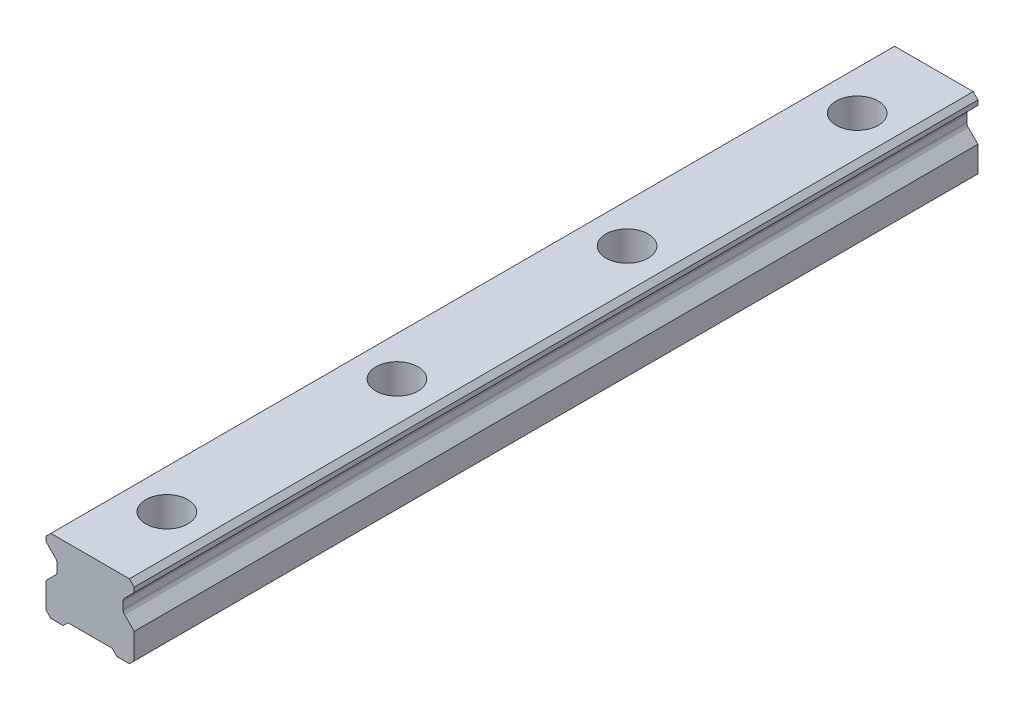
ISO-10303-21;
HEADER;
FILE_DESCRIPTION(('STEP AP214'),'2;1');
FILE_NAME('part.step','',(''),(''),'','','');
FILE_SCHEMA(('AUTOMOTIVE_DESIGN { 1 0 10303 214 1 1 1 1 }'));
ENDSEC;
DATA;
#1=APPLICATION_CONTEXT('core data for automotive mechanical design processes');
#2=APPLICATION_PROTOCOL_DEFINITION('international standard','automotive_design',2000,#1);
#3=PRODUCT_CONTEXT('',#1,'mechanical');
#4=PRODUCT('Part','Part','',(#3));
#5=PRODUCT_RELATED_PRODUCT_CATEGORY('part','',(#4));
#6=PRODUCT_DEFINITION_FORMATION('','',#4);
#7=PRODUCT_DEFINITION_CONTEXT('part definition',#1,'design');
#8=PRODUCT_DEFINITION('design','',#6,#7);
#9=PRODUCT_DEFINITION_SHAPE('','',#8);
#10=(LENGTH_UNIT() NAMED_UNIT(*) SI_UNIT(.MILLI.,.METRE.));
#11=(NAMED_UNIT(*) PLANE_ANGLE_UNIT() SI_UNIT($,.RADIAN.));
#12=(NAMED_UNIT(*) SI_UNIT($,.STERADIAN.) SOLID_ANGLE_UNIT());
#13=UNCERTAINTY_MEASURE_WITH_UNIT(LENGTH_MEASURE(1.E-05),#10,'distance_accuracy_value','');
#14=(GEOMETRIC_REPRESENTATION_CONTEXT(3) GLOBAL_UNCERTAINTY_ASSIGNED_CONTEXT((#13)) GLOBAL_UNIT_ASSIGNED_CONTEXT((#10,
#11,#12)) REPRESENTATION_CONTEXT('',''));
#15=CARTESIAN_POINT('',(0.,0.,0.));
#16=DIRECTION('',(0.,0.,1.));
#17=DIRECTION('',(1.,0.,0.));
#18=AXIS2_PLACEMENT_3D('',#15,#16,#17);
#19=CARTESIAN_POINT('',(0.,10.2,-90.));
#20=DIRECTION('',(0.,1.,0.));
#21=DIRECTION('',(0.,0.,1.));
#22=AXIS2_PLACEMENT_3D('',#19,#20,#21);
#23=PLANE('',#22);
#24=CARTESIAN_POINT('',(0.,10.2,-90.));
#25=DIRECTION('',(0.,1.,0.));
#26=DIRECTION('',(0.,0.,1.));
#27=AXIS2_PLACEMENT_3D('',#24,#25,#26);
#28=CIRCLE('',#27,3.5);
#29=CARTESIAN_POINT('',(0.,10.2,-86.5));
#30=VERTEX_POINT('',#29);
#31=EDGE_CURVE('E372',#30,#30,#28,.T.);
#32=ORIENTED_EDGE('',*,*,#31,.F.);
#33=EDGE_LOOP('',(#32));
#34=FACE_BOUND('',#33,.T.);
#35=CARTESIAN_POINT('',(0.,10.2,-90.));
#36=DIRECTION('',(0.,1.,0.));
#37=DIRECTION('',(0.,0.,1.));
#38=AXIS2_PLACEMENT_3D('',#35,#36,#37);
#39=CIRCLE('',#38,5.5);
#40=CARTESIAN_POINT('',(0.,10.2,-84.5));
#41=VERTEX_POINT('',#40);
#42=EDGE_CURVE('E11',#41,#41,#39,.T.);
#43=ORIENTED_EDGE('',*,*,#42,.T.);
#44=EDGE_LOOP('',(#43));
#45=FACE_BOUND('',#44,.T.);
#46=ADVANCED_FACE('F39',(#34,#45),#23,.T.);
#47=CARTESIAN_POINT('',(0.,10.2,-90.));
#48=DIRECTION('',(0.,1.,0.));
#49=DIRECTION('',(0.,0.,1.));
#50=AXIS2_PLACEMENT_3D('',#47,#48,#49);
#51=CYLINDRICAL_SURFACE('',#50,5.5);
#52=ORIENTED_EDGE('',*,*,#42,.F.);
#53=EDGE_LOOP('',(#52));
#54=FACE_BOUND('',#53,.T.);
#55=CARTESIAN_POINT('',(0.,19.2,-90.));
#56=DIRECTION('',(0.,1.,0.));
#57=DIRECTION('',(0.,0.,1.));
#58=AXIS2_PLACEMENT_3D('',#55,#56,#57);
#59=CIRCLE('',#58,5.5);
#60=CARTESIAN_POINT('',(0.,19.2,-84.5));
#61=VERTEX_POINT('',#60);
#62=EDGE_CURVE('E48',#61,#61,#59,.T.);
#63=ORIENTED_EDGE('',*,*,#62,.T.);
#64=EDGE_LOOP('',(#63));
#65=FACE_BOUND('',#64,.T.);
#66=ADVANCED_FACE('F570',(#54,#65),#51,.F.);
#67=CARTESIAN_POINT('',(0.,10.2,-30.));
#68=DIRECTION('',(0.,1.,0.));
#69=DIRECTION('',(0.,0.,1.));
#70=AXIS2_PLACEMENT_3D('',#67,#68,#69);
#71=PLANE('',#70);
#72=CARTESIAN_POINT('',(0.,10.2,-30.));
#73=DIRECTION('',(0.,1.,0.));
#74=DIRECTION('',(0.,0.,1.));
#75=AXIS2_PLACEMENT_3D('',#72,#73,#74);
#76=CIRCLE('',#75,3.5);
#77=CARTESIAN_POINT('',(0.,10.2,-26.5));
#78=VERTEX_POINT('',#77);
#79=EDGE_CURVE('E385',#78,#78,#76,.T.);
#80=ORIENTED_EDGE('',*,*,#79,.F.);
#81=EDGE_LOOP('',(#80));
#82=FACE_BOUND('',#81,.T.);
#83=CARTESIAN_POINT('',(0.,10.2,-30.));
#84=DIRECTION('',(0.,1.,0.));
#85=DIRECTION('',(0.,0.,1.));
#86=AXIS2_PLACEMENT_3D('',#83,#84,#85);
#87=CIRCLE('',#86,5.5);
#88=CARTESIAN_POINT('',(0.,10.2,-24.5));
#89=VERTEX_POINT('',#88);
#90=EDGE_CURVE('E358',#89,#89,#87,.T.);
#91=ORIENTED_EDGE('',*,*,#90,.T.);
#92=EDGE_LOOP('',(#91));
#93=FACE_BOUND('',#92,.T.);
#94=ADVANCED_FACE('F575',(#82,#93),#71,.T.);
#95=CARTESIAN_POINT('',(0.,10.2,-30.));
#96=DIRECTION('',(0.,1.,0.));
#97=DIRECTION('',(0.,0.,1.));
#98=AXIS2_PLACEMENT_3D('',#95,#96,#97);
#99=CYLINDRICAL_SURFACE('',#98,5.5);
#100=ORIENTED_EDGE('',*,*,#90,.F.);
#101=EDGE_LOOP('',(#100));
#102=FACE_BOUND('',#101,.T.);
#103=CARTESIAN_POINT('',(0.,19.2,-30.));
#104=DIRECTION('',(0.,1.,0.));
#105=DIRECTION('',(0.,0.,1.));
#106=AXIS2_PLACEMENT_3D('',#103,#104,#105);
#107=CIRCLE('',#106,5.5);
#108=CARTESIAN_POINT('',(0.,19.2,-24.5));
#109=VERTEX_POINT('',#108);
#110=EDGE_CURVE('E354',#109,#109,#107,.T.);
#111=ORIENTED_EDGE('',*,*,#110,.T.);
#112=EDGE_LOOP('',(#111));
#113=FACE_BOUND('',#112,.T.);
#114=ADVANCED_FACE('F632',(#102,#113),#99,.F.);
#115=CARTESIAN_POINT('',(11.5,0.,110.));
#116=DIRECTION('',(0.,1.,0.));
#117=DIRECTION('',(-1.,0.,0.));
#118=AXIS2_PLACEMENT_3D('',#115,#116,#117);
#119=PLANE('',#118);
#120=DIRECTION('',(1.,0.,0.));
#121=VECTOR('',#120,1.);
#122=CARTESIAN_POINT('',(11.5,0.,-110.));
#123=LINE('',#122,#121);
#124=CARTESIAN_POINT('',(-10.25,0.,-110.));
#125=VERTEX_POINT('',#124);
#126=CARTESIAN_POINT('',(-7.,0.,-110.));
#127=VERTEX_POINT('',#126);
#128=EDGE_CURVE('E229',#125,#127,#123,.T.);
#129=ORIENTED_EDGE('',*,*,#128,.T.);
#130=DIRECTION('',(0.,0.,1.));
#131=VECTOR('',#130,1.);
#132=CARTESIAN_POINT('',(-7.,0.,-110.));
#133=LINE('',#132,#131);
#134=CARTESIAN_POINT('',(-7.,0.,110.));
#135=VERTEX_POINT('',#134);
#136=EDGE_CURVE('E426',#127,#135,#133,.T.);
#137=ORIENTED_EDGE('',*,*,#136,.T.);
#138=DIRECTION('',(1.,0.,0.));
#139=VECTOR('',#138,1.);
#140=CARTESIAN_POINT('',(11.5,0.,110.));
#141=LINE('',#140,#139);
#142=CARTESIAN_POINT('',(-10.25,0.,110.));
#143=VERTEX_POINT('',#142);
#144=EDGE_CURVE('E495',#143,#135,#141,.T.);
#145=ORIENTED_EDGE('',*,*,#144,.F.);
#146=DIRECTION('',(0.,0.,-1.));
#147=VECTOR('',#146,1.);
#148=CARTESIAN_POINT('',(-10.25,0.,110.));
#149=LINE('',#148,#147);
#150=EDGE_CURVE('E289',#143,#125,#149,.T.);
#151=ORIENTED_EDGE('',*,*,#150,.T.);
#152=EDGE_LOOP('',(#129,#137,#145,#151));
#153=FACE_BOUND('',#152,.T.);
#154=ADVANCED_FACE('F602',(#153),#119,.F.);
#155=CARTESIAN_POINT('',(-11.5,19.2,110.));
#156=DIRECTION('',(1.,0.,0.));
#157=DIRECTION('',(0.,1.,0.));
#158=AXIS2_PLACEMENT_3D('',#155,#156,#157);
#159=PLANE('',#158);
#160=DIRECTION('',(0.,-1.,0.));
#161=VECTOR('',#160,1.);
#162=CARTESIAN_POINT('',(-11.5,19.2,110.));
#163=LINE('',#162,#161);
#164=CARTESIAN_POINT('',(-11.5,17.95,110.));
#165=VERTEX_POINT('',#164);
#166=CARTESIAN_POINT('',(-11.5,16.7,110.));
#167=VERTEX_POINT('',#166);
#168=EDGE_CURVE('E491',#165,#167,#163,.T.);
#169=ORIENTED_EDGE('',*,*,#168,.F.);
#170=DIRECTION('',(0.,0.,-1.));
#171=VECTOR('',#170,1.);
#172=CARTESIAN_POINT('',(-11.5,17.95,110.));
#173=LINE('',#172,#171);
#174=CARTESIAN_POINT('',(-11.5,17.95,-110.));
#175=VERTEX_POINT('',#174);
#176=EDGE_CURVE('E252',#165,#175,#173,.T.);
#177=ORIENTED_EDGE('',*,*,#176,.T.);
#178=DIRECTION('',(0.,-1.,0.));
#179=VECTOR('',#178,1.);
#180=CARTESIAN_POINT('',(-11.5,19.2,-110.));
#181=LINE('',#180,#179);
#182=CARTESIAN_POINT('',(-11.5,16.7,-110.));
#183=VERTEX_POINT('',#182);
#184=EDGE_CURVE('E230',#175,#183,#181,.T.);
#185=ORIENTED_EDGE('',*,*,#184,.T.);
#186=DIRECTION('',(0.,0.,1.));
#187=VECTOR('',#186,1.);
#188=CARTESIAN_POINT('',(-11.5,16.7,-110.));
#189=LINE('',#188,#187);
#190=EDGE_CURVE('E446',#183,#167,#189,.T.);
#191=ORIENTED_EDGE('',*,*,#190,.T.);
#192=EDGE_LOOP('',(#169,#177,#185,#191));
#193=FACE_BOUND('',#192,.T.);
#194=ADVANCED_FACE('F520',(#193),#159,.F.);
#195=CARTESIAN_POINT('',(11.5,19.2,110.));
#196=DIRECTION('',(-1.,0.,0.));
#197=DIRECTION('',(0.,0.,1.));
#198=AXIS2_PLACEMENT_3D('',#195,#196,#197);
#199=PLANE('',#198);
#200=DIRECTION('',(0.,1.,0.));
#201=VECTOR('',#200,1.);
#202=CARTESIAN_POINT('',(11.5,19.2,110.));
#203=LINE('',#202,#201);
#204=CARTESIAN_POINT('',(11.5,1.25,110.));
#205=VERTEX_POINT('',#204);
#206=CARTESIAN_POINT('',(11.5,7.95,110.));
#207=VERTEX_POINT('',#206);
#208=EDGE_CURVE('E500',#205,#207,#203,.T.);
#209=ORIENTED_EDGE('',*,*,#208,.F.);
#210=DIRECTION('',(0.,0.,-1.));
#211=VECTOR('',#210,1.);
#212=CARTESIAN_POINT('',(11.5,1.25,110.));
#213=LINE('',#212,#211);
#214=CARTESIAN_POINT('',(11.5,1.25,-110.));
#215=VERTEX_POINT('',#214);
#216=EDGE_CURVE('E296',#205,#215,#213,.T.);
#217=ORIENTED_EDGE('',*,*,#216,.T.);
#218=DIRECTION('',(0.,1.,0.));
#219=VECTOR('',#218,1.);
#220=CARTESIAN_POINT('',(11.5,19.2,-110.));
#221=LINE('',#220,#219);
#222=CARTESIAN_POINT('',(11.5,7.95,-110.));
#223=VERTEX_POINT('',#222);
#224=EDGE_CURVE('E243',#215,#223,#221,.T.);
#225=ORIENTED_EDGE('',*,*,#224,.T.);
#226=DIRECTION('',(0.,0.,1.));
#227=VECTOR('',#226,1.);
#228=CARTESIAN_POINT('',(11.5,7.95,-110.));
#229=LINE('',#228,#227);
#230=EDGE_CURVE('E476',#223,#207,#229,.T.);
#231=ORIENTED_EDGE('',*,*,#230,.T.);
#232=EDGE_LOOP('',(#209,#217,#225,#231));
#233=FACE_BOUND('',#232,.T.);
#234=ADVANCED_FACE('F595',(#233),#199,.F.);
#235=CARTESIAN_POINT('',(-11.5,7.95,-110.));
#236=VERTEX_POINT('',#235);
#237=CARTESIAN_POINT('',(-11.5,1.24999999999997,-110.));
#238=VERTEX_POINT('',#237);
#239=EDGE_CURVE('E239',#236,#238,#181,.T.);
#240=ORIENTED_EDGE('',*,*,#239,.T.);
#241=DIRECTION('',(0.,0.,1.));
#242=VECTOR('',#241,1.);
#243=CARTESIAN_POINT('',(-11.5,1.24999999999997,110.));
#244=LINE('',#243,#242);
#245=CARTESIAN_POINT('',(-11.5,1.24999999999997,110.));
#246=VERTEX_POINT('',#245);
#247=EDGE_CURVE('E293',#238,#246,#244,.T.);
#248=ORIENTED_EDGE('',*,*,#247,.T.);
#249=CARTESIAN_POINT('',(-11.5,7.95,110.));
#250=VERTEX_POINT('',#249);
#251=EDGE_CURVE('E251',#250,#246,#163,.T.);
#252=ORIENTED_EDGE('',*,*,#251,.F.);
#253=DIRECTION('',(0.,0.,1.));
#254=VECTOR('',#253,1.);
#255=CARTESIAN_POINT('',(-11.5,7.95,-110.));
#256=LINE('',#255,#254);
#257=EDGE_CURVE('E458',#236,#250,#256,.T.);
#258=ORIENTED_EDGE('',*,*,#257,.F.);
#259=EDGE_LOOP('',(#240,#248,#252,#258));
#260=FACE_BOUND('',#259,.T.);
#261=ADVANCED_FACE('F548',(#260),#159,.F.);
#262=CARTESIAN_POINT('',(7.,0.,110.));
#263=VERTEX_POINT('',#262);
#264=CARTESIAN_POINT('',(10.25,0.,110.));
#265=VERTEX_POINT('',#264);
#266=EDGE_CURVE('E219',#263,#265,#141,.T.);
#267=ORIENTED_EDGE('',*,*,#266,.F.);
#268=DIRECTION('',(0.,0.,1.));
#269=VECTOR('',#268,1.);
#270=CARTESIAN_POINT('',(7.,0.,-110.));
#271=LINE('',#270,#269);
#272=CARTESIAN_POINT('',(7.,0.,-110.));
#273=VERTEX_POINT('',#272);
#274=EDGE_CURVE('E206',#273,#263,#271,.T.);
#275=ORIENTED_EDGE('',*,*,#274,.F.);
#276=CARTESIAN_POINT('',(10.25,0.,-110.));
#277=VERTEX_POINT('',#276);
#278=EDGE_CURVE('E217',#273,#277,#123,.T.);
#279=ORIENTED_EDGE('',*,*,#278,.T.);
#280=DIRECTION('',(0.,0.,1.));
#281=VECTOR('',#280,1.);
#282=CARTESIAN_POINT('',(10.25,0.,110.));
#283=LINE('',#282,#281);
#284=EDGE_CURVE('E286',#277,#265,#283,.T.);
#285=ORIENTED_EDGE('',*,*,#284,.T.);
#286=EDGE_LOOP('',(#267,#275,#279,#285));
#287=FACE_BOUND('',#286,.T.);
#288=ADVANCED_FACE('F215',(#287),#119,.F.);
#289=CARTESIAN_POINT('',(11.5,16.7,-110.));
#290=VERTEX_POINT('',#289);
#291=CARTESIAN_POINT('',(11.5,17.95,-110.));
#292=VERTEX_POINT('',#291);
#293=EDGE_CURVE('E236',#290,#292,#221,.T.);
#294=ORIENTED_EDGE('',*,*,#293,.T.);
#295=DIRECTION('',(0.,0.,1.));
#296=VECTOR('',#295,1.);
#297=CARTESIAN_POINT('',(11.5,17.95,110.));
#298=LINE('',#297,#296);
#299=CARTESIAN_POINT('',(11.5,17.95,110.));
#300=VERTEX_POINT('',#299);
#301=EDGE_CURVE('E300',#292,#300,#298,.T.);
#302=ORIENTED_EDGE('',*,*,#301,.T.);
#303=CARTESIAN_POINT('',(11.5,16.7,110.));
#304=VERTEX_POINT('',#303);
#305=EDGE_CURVE('E499',#304,#300,#203,.T.);
#306=ORIENTED_EDGE('',*,*,#305,.F.);
#307=DIRECTION('',(0.,0.,1.));
#308=VECTOR('',#307,1.);
#309=CARTESIAN_POINT('',(11.5,16.7,-110.));
#310=LINE('',#309,#308);
#311=EDGE_CURVE('E451',#290,#304,#310,.T.);
#312=ORIENTED_EDGE('',*,*,#311,.F.);
#313=EDGE_LOOP('',(#294,#302,#306,#312));
#314=FACE_BOUND('',#313,.T.);
#315=ADVANCED_FACE('F585',(#314),#199,.F.);
#316=CARTESIAN_POINT('',(11.5,19.2,110.));
#317=DIRECTION('',(0.,-1.,0.));
#318=DIRECTION('',(0.,0.,-1.));
#319=AXIS2_PLACEMENT_3D('',#316,#317,#318);
#320=PLANE('',#319);
#321=CARTESIAN_POINT('',(0.,19.2,30.));
#322=DIRECTION('',(0.,1.,0.));
#323=DIRECTION('',(0.,0.,1.));
#324=AXIS2_PLACEMENT_3D('',#321,#322,#323);
#325=CIRCLE('',#324,5.5);
#326=CARTESIAN_POINT('',(0.,19.2,35.5));
#327=VERTEX_POINT('',#326);
#328=EDGE_CURVE('E389',#327,#327,#325,.T.);
#329=ORIENTED_EDGE('',*,*,#328,.F.);
#330=EDGE_LOOP('',(#329));
#331=FACE_BOUND('',#330,.T.);
#332=CARTESIAN_POINT('',(0.,19.2,90.));
#333=DIRECTION('',(0.,1.,0.));
#334=DIRECTION('',(0.,0.,1.));
#335=AXIS2_PLACEMENT_3D('',#332,#333,#334);
#336=CIRCLE('',#335,5.5);
#337=CARTESIAN_POINT('',(0.,19.2,95.5));
#338=VERTEX_POINT('',#337);
#339=EDGE_CURVE('E405',#338,#338,#336,.T.);
#340=ORIENTED_EDGE('',*,*,#339,.F.);
#341=EDGE_LOOP('',(#340));
#342=FACE_BOUND('',#341,.T.);
#343=DIRECTION('',(-1.,0.,0.));
#344=VECTOR('',#343,1.);
#345=CARTESIAN_POINT('',(11.5,19.2,-110.));
#346=LINE('',#345,#344);
#347=CARTESIAN_POINT('',(10.25,19.2,-110.));
#348=VERTEX_POINT('',#347);
#349=CARTESIAN_POINT('',(-10.25,19.2,-110.));
#350=VERTEX_POINT('',#349);
#351=EDGE_CURVE('E247',#348,#350,#346,.T.);
#352=ORIENTED_EDGE('',*,*,#351,.T.);
#353=DIRECTION('',(0.,0.,1.));
#354=VECTOR('',#353,1.);
#355=CARTESIAN_POINT('',(-10.25,19.2,110.));
#356=LINE('',#355,#354);
#357=CARTESIAN_POINT('',(-10.25,19.2,110.));
#358=VERTEX_POINT('',#357);
#359=EDGE_CURVE('E272',#350,#358,#356,.T.);
#360=ORIENTED_EDGE('',*,*,#359,.T.);
#361=DIRECTION('',(-1.,0.,0.));
#362=VECTOR('',#361,1.);
#363=CARTESIAN_POINT('',(11.5,19.2,110.));
#364=LINE('',#363,#362);
#365=CARTESIAN_POINT('',(10.25,19.2,110.));
#366=VERTEX_POINT('',#365);
#367=EDGE_CURVE('E257',#366,#358,#364,.T.);
#368=ORIENTED_EDGE('',*,*,#367,.F.);
#369=DIRECTION('',(0.,0.,-1.));
#370=VECTOR('',#369,1.);
#371=CARTESIAN_POINT('',(10.25,19.2,110.));
#372=LINE('',#371,#370);
#373=EDGE_CURVE('E268',#366,#348,#372,.T.);
#374=ORIENTED_EDGE('',*,*,#373,.T.);
#375=EDGE_LOOP('',(#352,#360,#368,#374));
#376=FACE_BOUND('',#375,.T.);
#377=ORIENTED_EDGE('',*,*,#110,.F.);
#378=EDGE_LOOP('',(#377));
#379=FACE_BOUND('',#378,.T.);
#380=ORIENTED_EDGE('',*,*,#62,.F.);
#381=EDGE_LOOP('',(#380));
#382=FACE_BOUND('',#381,.T.);
#383=ADVANCED_FACE('F583',(#331,#342,#376,#379,#382),#320,.F.);
#384=CARTESIAN_POINT('',(0.,0.,110.));
#385=DIRECTION('',(0.,0.,-1.));
#386=DIRECTION('',(-1.,0.,0.));
#387=AXIS2_PLACEMENT_3D('',#384,#385,#386);
#388=PLANE('',#387);
#389=ORIENTED_EDGE('',*,*,#144,.T.);
#390=DIRECTION('',(-0.707106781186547,-0.707106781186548,0.));
#391=VECTOR('',#390,1.);
#392=CARTESIAN_POINT('',(-7.,0.,110.));
#393=LINE('',#392,#391);
#394=CARTESIAN_POINT('',(-5.75,1.25,110.));
#395=VERTEX_POINT('',#394);
#396=EDGE_CURVE('E211',#395,#135,#393,.T.);
#397=ORIENTED_EDGE('',*,*,#396,.F.);
#398=DIRECTION('',(-1.,0.,0.));
#399=VECTOR('',#398,1.);
#400=CARTESIAN_POINT('',(-5.75,1.25,110.));
#401=LINE('',#400,#399);
#402=CARTESIAN_POINT('',(5.75,1.25,110.));
#403=VERTEX_POINT('',#402);
#404=EDGE_CURVE('E420',#403,#395,#401,.T.);
#405=ORIENTED_EDGE('',*,*,#404,.F.);
#406=DIRECTION('',(-0.707106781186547,0.707106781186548,0.));
#407=VECTOR('',#406,1.);
#408=CARTESIAN_POINT('',(5.75,1.25,110.));
#409=LINE('',#408,#407);
#410=EDGE_CURVE('E410',#263,#403,#409,.T.);
#411=ORIENTED_EDGE('',*,*,#410,.F.);
#412=ORIENTED_EDGE('',*,*,#266,.T.);
#413=DIRECTION('',(-0.707106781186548,-0.707106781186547,0.));
#414=VECTOR('',#413,1.);
#415=CARTESIAN_POINT('',(11.5,1.25,110.));
#416=LINE('',#415,#414);
#417=EDGE_CURVE('E278',#265,#205,#416,.F.);
#418=ORIENTED_EDGE('',*,*,#417,.T.);
#419=ORIENTED_EDGE('',*,*,#208,.T.);
#420=DIRECTION('',(0.707106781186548,-0.707106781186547,0.));
#421=VECTOR('',#420,1.);
#422=CARTESIAN_POINT('',(11.5,7.95,110.));
#423=LINE('',#422,#421);
#424=CARTESIAN_POINT('',(8.94944985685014,10.5005501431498,110.));
#425=VERTEX_POINT('',#424);
#426=EDGE_CURVE('E430',#425,#207,#423,.T.);
#427=ORIENTED_EDGE('',*,*,#426,.F.);
#428=CARTESIAN_POINT('',(9.83333333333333,11.384433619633,110.));
#429=DIRECTION('',(0.,0.,-1.));
#430=DIRECTION('',(-1.,0.,0.));
#431=AXIS2_PLACEMENT_3D('',#428,#429,#430);
#432=CIRCLE('',#431,1.25);
#433=CARTESIAN_POINT('',(8.58333333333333,11.384433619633,110.));
#434=VERTEX_POINT('',#433);
#435=EDGE_CURVE('E331',#425,#434,#432,.T.);
#436=ORIENTED_EDGE('',*,*,#435,.T.);
#437=DIRECTION('',(0.,-1.,0.));
#438=VECTOR('',#437,1.);
#439=CARTESIAN_POINT('',(8.58333333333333,10.8666666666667,110.));
#440=LINE('',#439,#438);
#441=CARTESIAN_POINT('',(8.58333333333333,13.265566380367,110.));
#442=VERTEX_POINT('',#441);
#443=EDGE_CURVE('E468',#442,#434,#440,.T.);
#444=ORIENTED_EDGE('',*,*,#443,.F.);
#445=CARTESIAN_POINT('',(9.83333333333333,13.265566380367,110.));
#446=DIRECTION('',(0.,0.,-1.));
#447=DIRECTION('',(-1.,0.,0.));
#448=AXIS2_PLACEMENT_3D('',#445,#446,#447);
#449=CIRCLE('',#448,1.25);
#450=CARTESIAN_POINT('',(8.94944985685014,14.1494498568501,110.));
#451=VERTEX_POINT('',#450);
#452=EDGE_CURVE('E337',#442,#451,#449,.T.);
#453=ORIENTED_EDGE('',*,*,#452,.T.);
#454=DIRECTION('',(-0.707106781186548,-0.707106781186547,0.));
#455=VECTOR('',#454,1.);
#456=CARTESIAN_POINT('',(8.58333333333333,13.7833333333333,110.));
#457=LINE('',#456,#455);
#458=EDGE_CURVE('E479',#304,#451,#457,.T.);
#459=ORIENTED_EDGE('',*,*,#458,.F.);
#460=ORIENTED_EDGE('',*,*,#305,.T.);
#461=DIRECTION('',(0.707106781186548,-0.707106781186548,0.));
#462=VECTOR('',#461,1.);
#463=CARTESIAN_POINT('',(10.25,19.2,110.));
#464=LINE('',#463,#462);
#465=EDGE_CURVE('E275',#300,#366,#464,.F.);
#466=ORIENTED_EDGE('',*,*,#465,.T.);
#467=ORIENTED_EDGE('',*,*,#367,.T.);
#468=DIRECTION('',(0.70710678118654,0.707106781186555,0.));
#469=VECTOR('',#468,1.);
#470=CARTESIAN_POINT('',(-11.5,17.95,110.));
#471=LINE('',#470,#469);
#472=EDGE_CURVE('E283',#358,#165,#471,.F.);
#473=ORIENTED_EDGE('',*,*,#472,.T.);
#474=ORIENTED_EDGE('',*,*,#168,.T.);
#475=DIRECTION('',(-0.707106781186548,0.707106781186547,0.));
#476=VECTOR('',#475,1.);
#477=CARTESIAN_POINT('',(-8.58333333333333,13.7833333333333,110.));
#478=LINE('',#477,#476);
#479=CARTESIAN_POINT('',(-8.94944985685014,14.1494498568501,110.));
#480=VERTEX_POINT('',#479);
#481=EDGE_CURVE('E447',#480,#167,#478,.T.);
#482=ORIENTED_EDGE('',*,*,#481,.F.);
#483=CARTESIAN_POINT('',(-9.83333333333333,13.265566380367,110.));
#484=DIRECTION('',(0.,0.,-1.));
#485=DIRECTION('',(-1.,0.,0.));
#486=AXIS2_PLACEMENT_3D('',#483,#484,#485);
#487=CIRCLE('',#486,1.25);
#488=CARTESIAN_POINT('',(-8.58333333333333,13.265566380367,110.));
#489=VERTEX_POINT('',#488);
#490=EDGE_CURVE('E349',#480,#489,#487,.T.);
#491=ORIENTED_EDGE('',*,*,#490,.T.);
#492=DIRECTION('',(0.,1.,0.));
#493=VECTOR('',#492,1.);
#494=CARTESIAN_POINT('',(-8.58333333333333,10.8666666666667,110.));
#495=LINE('',#494,#493);
#496=CARTESIAN_POINT('',(-8.58333333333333,11.384433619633,110.));
#497=VERTEX_POINT('',#496);
#498=EDGE_CURVE('E439',#497,#489,#495,.T.);
#499=ORIENTED_EDGE('',*,*,#498,.F.);
#500=CARTESIAN_POINT('',(-9.83333333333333,11.384433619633,110.));
#501=DIRECTION('',(0.,0.,-1.));
#502=DIRECTION('',(-1.,0.,0.));
#503=AXIS2_PLACEMENT_3D('',#500,#501,#502);
#504=CIRCLE('',#503,1.25);
#505=CARTESIAN_POINT('',(-8.94944985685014,10.5005501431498,110.));
#506=VERTEX_POINT('',#505);
#507=EDGE_CURVE('E343',#497,#506,#504,.T.);
#508=ORIENTED_EDGE('',*,*,#507,.T.);
#509=DIRECTION('',(0.707106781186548,0.707106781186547,0.));
#510=VECTOR('',#509,1.);
#511=CARTESIAN_POINT('',(-11.5,7.95,110.));
#512=LINE('',#511,#510);
#513=EDGE_CURVE('E450',#250,#506,#512,.T.);
#514=ORIENTED_EDGE('',*,*,#513,.F.);
#515=ORIENTED_EDGE('',*,*,#251,.T.);
#516=DIRECTION('',(-0.707106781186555,0.70710678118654,0.));
#517=VECTOR('',#516,1.);
#518=CARTESIAN_POINT('',(-10.25,0.,110.));
#519=LINE('',#518,#517);
#520=EDGE_CURVE('E281',#246,#143,#519,.F.);
#521=ORIENTED_EDGE('',*,*,#520,.T.);
#522=EDGE_LOOP('',(#389,#397,#405,#411,#412,#418,#419,#427,#436,#444,#453,#459,#460,#466,#467,
#473,#474,#482,#491,#499,#508,#514,#515,#521));
#523=FACE_BOUND('',#522,.T.);
#524=ADVANCED_FACE('F508',(#523),#388,.F.);
#525=CARTESIAN_POINT('',(0.,0.,-110.));
#526=DIRECTION('',(0.,0.,-1.));
#527=DIRECTION('',(-1.,0.,0.));
#528=AXIS2_PLACEMENT_3D('',#525,#526,#527);
#529=PLANE('',#528);
#530=DIRECTION('',(-0.707106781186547,-0.707106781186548,0.));
#531=VECTOR('',#530,1.);
#532=CARTESIAN_POINT('',(-7.,0.,-110.));
#533=LINE('',#532,#531);
#534=CARTESIAN_POINT('',(-5.75,1.25,-110.));
#535=VERTEX_POINT('',#534);
#536=EDGE_CURVE('E221',#535,#127,#533,.T.);
#537=ORIENTED_EDGE('',*,*,#536,.T.);
#538=ORIENTED_EDGE('',*,*,#128,.F.);
#539=DIRECTION('',(0.707106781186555,-0.70710678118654,0.));
#540=VECTOR('',#539,1.);
#541=CARTESIAN_POINT('',(-5.12499999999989,-5.125,-110.));
#542=LINE('',#541,#540);
#543=EDGE_CURVE('E262',#125,#238,#542,.F.);
#544=ORIENTED_EDGE('',*,*,#543,.T.);
#545=ORIENTED_EDGE('',*,*,#239,.F.);
#546=DIRECTION('',(0.707106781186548,0.707106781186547,0.));
#547=VECTOR('',#546,1.);
#548=CARTESIAN_POINT('',(-11.5,7.95,-110.));
#549=LINE('',#548,#547);
#550=CARTESIAN_POINT('',(-8.94944985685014,10.5005501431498,-110.));
#551=VERTEX_POINT('',#550);
#552=EDGE_CURVE('E438',#236,#551,#549,.T.);
#553=ORIENTED_EDGE('',*,*,#552,.T.);
#554=CARTESIAN_POINT('',(-9.83333333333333,11.384433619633,-110.));
#555=DIRECTION('',(0.,0.,-1.));
#556=DIRECTION('',(-1.,0.,0.));
#557=AXIS2_PLACEMENT_3D('',#554,#555,#556);
#558=CIRCLE('',#557,1.25);
#559=CARTESIAN_POINT('',(-8.58333333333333,11.384433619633,-110.));
#560=VERTEX_POINT('',#559);
#561=EDGE_CURVE('E346',#551,#560,#558,.F.);
#562=ORIENTED_EDGE('',*,*,#561,.T.);
#563=DIRECTION('',(0.,1.,0.));
#564=VECTOR('',#563,1.);
#565=CARTESIAN_POINT('',(-8.58333333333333,10.8666666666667,-110.));
#566=LINE('',#565,#564);
#567=CARTESIAN_POINT('',(-8.58333333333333,13.265566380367,-110.));
#568=VERTEX_POINT('',#567);
#569=EDGE_CURVE('E443',#560,#568,#566,.T.);
#570=ORIENTED_EDGE('',*,*,#569,.T.);
#571=CARTESIAN_POINT('',(-9.83333333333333,13.265566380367,-110.));
#572=DIRECTION('',(0.,0.,-1.));
#573=DIRECTION('',(-1.,0.,0.));
#574=AXIS2_PLACEMENT_3D('',#571,#572,#573);
#575=CIRCLE('',#574,1.25);
#576=CARTESIAN_POINT('',(-8.94944985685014,14.1494498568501,-110.));
#577=VERTEX_POINT('',#576);
#578=EDGE_CURVE('E64',#568,#577,#575,.F.);
#579=ORIENTED_EDGE('',*,*,#578,.T.);
#580=DIRECTION('',(-0.707106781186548,0.707106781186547,0.));
#581=VECTOR('',#580,1.);
#582=CARTESIAN_POINT('',(-8.58333333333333,13.7833333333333,-110.));
#583=LINE('',#582,#581);
#584=EDGE_CURVE('E435',#577,#183,#583,.T.);
#585=ORIENTED_EDGE('',*,*,#584,.T.);
#586=ORIENTED_EDGE('',*,*,#184,.F.);
#587=DIRECTION('',(-0.70710678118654,-0.707106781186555,0.));
#588=VECTOR('',#587,1.);
#589=CARTESIAN_POINT('',(-14.7250000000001,14.7249999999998,-110.));
#590=LINE('',#589,#588);
#591=EDGE_CURVE('E265',#175,#350,#590,.F.);
#592=ORIENTED_EDGE('',*,*,#591,.T.);
#593=ORIENTED_EDGE('',*,*,#351,.F.);
#594=DIRECTION('',(-0.707106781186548,0.707106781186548,0.));
#595=VECTOR('',#594,1.);
#596=CARTESIAN_POINT('',(14.725,14.725,-110.));
#597=LINE('',#596,#595);
#598=EDGE_CURVE('E256',#348,#292,#597,.F.);
#599=ORIENTED_EDGE('',*,*,#598,.T.);
#600=ORIENTED_EDGE('',*,*,#293,.F.);
#601=DIRECTION('',(-0.707106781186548,-0.707106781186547,0.));
#602=VECTOR('',#601,1.);
#603=CARTESIAN_POINT('',(8.58333333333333,13.7833333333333,-110.));
#604=LINE('',#603,#602);
#605=CARTESIAN_POINT('',(8.94944985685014,14.1494498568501,-110.));
#606=VERTEX_POINT('',#605);
#607=EDGE_CURVE('E467',#290,#606,#604,.T.);
#608=ORIENTED_EDGE('',*,*,#607,.T.);
#609=CARTESIAN_POINT('',(9.83333333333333,13.265566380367,-110.));
#610=DIRECTION('',(0.,0.,-1.));
#611=DIRECTION('',(-1.,0.,0.));
#612=AXIS2_PLACEMENT_3D('',#609,#610,#611);
#613=CIRCLE('',#612,1.25);
#614=CARTESIAN_POINT('',(8.58333333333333,13.265566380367,-110.));
#615=VERTEX_POINT('',#614);
#616=EDGE_CURVE('E340',#606,#615,#613,.F.);
#617=ORIENTED_EDGE('',*,*,#616,.T.);
#618=DIRECTION('',(0.,-1.,0.));
#619=VECTOR('',#618,1.);
#620=CARTESIAN_POINT('',(8.58333333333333,10.8666666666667,-110.));
#621=LINE('',#620,#619);
#622=CARTESIAN_POINT('',(8.58333333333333,11.384433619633,-110.));
#623=VERTEX_POINT('',#622);
#624=EDGE_CURVE('E472',#615,#623,#621,.T.);
#625=ORIENTED_EDGE('',*,*,#624,.T.);
#626=CARTESIAN_POINT('',(9.83333333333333,11.384433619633,-110.));
#627=DIRECTION('',(0.,0.,-1.));
#628=DIRECTION('',(-1.,0.,0.));
#629=AXIS2_PLACEMENT_3D('',#626,#627,#628);
#630=CIRCLE('',#629,1.25);
#631=CARTESIAN_POINT('',(8.94944985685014,10.5005501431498,-110.));
#632=VERTEX_POINT('',#631);
#633=EDGE_CURVE('E334',#623,#632,#630,.F.);
#634=ORIENTED_EDGE('',*,*,#633,.T.);
#635=DIRECTION('',(0.707106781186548,-0.707106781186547,0.));
#636=VECTOR('',#635,1.);
#637=CARTESIAN_POINT('',(11.5,7.95,-110.));
#638=LINE('',#637,#636);
#639=EDGE_CURVE('E464',#632,#223,#638,.T.);
#640=ORIENTED_EDGE('',*,*,#639,.T.);
#641=ORIENTED_EDGE('',*,*,#224,.F.);
#642=DIRECTION('',(0.707106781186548,0.707106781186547,0.));
#643=VECTOR('',#642,1.);
#644=CARTESIAN_POINT('',(5.12499999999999,-5.125,-110.));
#645=LINE('',#644,#643);
#646=EDGE_CURVE('E226',#215,#277,#645,.F.);
#647=ORIENTED_EDGE('',*,*,#646,.T.);
#648=ORIENTED_EDGE('',*,*,#278,.F.);
#649=DIRECTION('',(-0.707106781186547,0.707106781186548,0.));
#650=VECTOR('',#649,1.);
#651=CARTESIAN_POINT('',(5.75,1.25,-110.));
#652=LINE('',#651,#650);
#653=CARTESIAN_POINT('',(5.75,1.25,-110.));
#654=VERTEX_POINT('',#653);
#655=EDGE_CURVE('E202',#273,#654,#652,.T.);
#656=ORIENTED_EDGE('',*,*,#655,.T.);
#657=DIRECTION('',(-1.,0.,0.));
#658=VECTOR('',#657,1.);
#659=CARTESIAN_POINT('',(-5.75,1.25,-110.));
#660=LINE('',#659,#658);
#661=EDGE_CURVE('E56',#654,#535,#660,.T.);
#662=ORIENTED_EDGE('',*,*,#661,.T.);
#663=EDGE_LOOP('',(#537,#538,#544,#545,#553,#562,#570,#579,#585,#586,#592,#593,#599,#600,#608,
#617,#625,#634,#640,#641,#647,#648,#656,#662));
#664=FACE_BOUND('',#663,.T.);
#665=ADVANCED_FACE('F224',(#664),#529,.T.);
#666=CARTESIAN_POINT('',(11.5,7.95,-110.));
#667=DIRECTION('',(-0.707106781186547,-0.707106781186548,0.));
#668=DIRECTION('',(0.707106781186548,-0.707106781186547,0.));
#669=AXIS2_PLACEMENT_3D('',#666,#667,#668);
#670=PLANE('',#669);
#671=ORIENTED_EDGE('',*,*,#639,.F.);
#672=DIRECTION('',(0.,0.,1.));
#673=VECTOR('',#672,1.);
#674=CARTESIAN_POINT('',(8.94944985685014,10.5005501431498,110.));
#675=LINE('',#674,#673);
#676=EDGE_CURVE('E303',#632,#425,#675,.T.);
#677=ORIENTED_EDGE('',*,*,#676,.T.);
#678=ORIENTED_EDGE('',*,*,#426,.T.);
#679=ORIENTED_EDGE('',*,*,#230,.F.);
#680=EDGE_LOOP('',(#671,#677,#678,#679));
#681=FACE_BOUND('',#680,.T.);
#682=ADVANCED_FACE('F691',(#681),#670,.F.);
#683=CARTESIAN_POINT('',(8.58333333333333,10.8666666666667,-110.));
#684=DIRECTION('',(-1.,0.,0.));
#685=DIRECTION('',(0.,0.,1.));
#686=AXIS2_PLACEMENT_3D('',#683,#684,#685);
#687=PLANE('',#686);
#688=ORIENTED_EDGE('',*,*,#443,.T.);
#689=DIRECTION('',(0.,0.,1.));
#690=VECTOR('',#689,1.);
#691=CARTESIAN_POINT('',(8.58333333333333,11.384433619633,-110.));
#692=LINE('',#691,#690);
#693=EDGE_CURVE('E311',#434,#623,#692,.F.);
#694=ORIENTED_EDGE('',*,*,#693,.T.);
#695=ORIENTED_EDGE('',*,*,#624,.F.);
#696=DIRECTION('',(0.,0.,1.));
#697=VECTOR('',#696,1.);
#698=CARTESIAN_POINT('',(8.58333333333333,13.265566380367,110.));
#699=LINE('',#698,#697);
#700=EDGE_CURVE('E307',#615,#442,#699,.T.);
#701=ORIENTED_EDGE('',*,*,#700,.T.);
#702=EDGE_LOOP('',(#688,#694,#695,#701));
#703=FACE_BOUND('',#702,.T.);
#704=ADVANCED_FACE('F699',(#703),#687,.F.);
#705=CARTESIAN_POINT('',(8.58333333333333,13.7833333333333,-110.));
#706=DIRECTION('',(-0.707106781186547,0.707106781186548,0.));
#707=DIRECTION('',(-0.707106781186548,-0.707106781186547,0.));
#708=AXIS2_PLACEMENT_3D('',#705,#706,#707);
#709=PLANE('',#708);
#710=ORIENTED_EDGE('',*,*,#458,.T.);
#711=DIRECTION('',(0.,0.,1.));
#712=VECTOR('',#711,1.);
#713=CARTESIAN_POINT('',(8.94944985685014,14.1494498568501,-110.));
#714=LINE('',#713,#712);
#715=EDGE_CURVE('E314',#451,#606,#714,.F.);
#716=ORIENTED_EDGE('',*,*,#715,.T.);
#717=ORIENTED_EDGE('',*,*,#607,.F.);
#718=ORIENTED_EDGE('',*,*,#311,.T.);
#719=EDGE_LOOP('',(#710,#716,#717,#718));
#720=FACE_BOUND('',#719,.T.);
#721=ADVANCED_FACE('F709',(#720),#709,.F.);
#722=CARTESIAN_POINT('',(-8.58333333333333,13.7833333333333,-110.));
#723=DIRECTION('',(0.707106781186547,0.707106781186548,0.));
#724=DIRECTION('',(-0.707106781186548,0.707106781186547,0.));
#725=AXIS2_PLACEMENT_3D('',#722,#723,#724);
#726=PLANE('',#725);
#727=ORIENTED_EDGE('',*,*,#584,.F.);
#728=DIRECTION('',(0.,0.,1.));
#729=VECTOR('',#728,1.);
#730=CARTESIAN_POINT('',(-8.94944985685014,14.1494498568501,110.));
#731=LINE('',#730,#729);
#732=EDGE_CURVE('E327',#577,#480,#731,.T.);
#733=ORIENTED_EDGE('',*,*,#732,.T.);
#734=ORIENTED_EDGE('',*,*,#481,.T.);
#735=ORIENTED_EDGE('',*,*,#190,.F.);
#736=EDGE_LOOP('',(#727,#733,#734,#735));
#737=FACE_BOUND('',#736,.T.);
#738=ADVANCED_FACE('F525',(#737),#726,.F.);
#739=CARTESIAN_POINT('',(-8.58333333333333,10.8666666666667,-110.));
#740=DIRECTION('',(1.,0.,0.));
#741=DIRECTION('',(0.,0.,-1.));
#742=AXIS2_PLACEMENT_3D('',#739,#740,#741);
#743=PLANE('',#742);
#744=ORIENTED_EDGE('',*,*,#569,.F.);
#745=DIRECTION('',(0.,0.,1.));
#746=VECTOR('',#745,1.);
#747=CARTESIAN_POINT('',(-8.58333333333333,11.384433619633,110.));
#748=LINE('',#747,#746);
#749=EDGE_CURVE('E320',#560,#497,#748,.T.);
#750=ORIENTED_EDGE('',*,*,#749,.T.);
#751=ORIENTED_EDGE('',*,*,#498,.T.);
#752=DIRECTION('',(0.,0.,1.));
#753=VECTOR('',#752,1.);
#754=CARTESIAN_POINT('',(-8.58333333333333,13.265566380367,-110.));
#755=LINE('',#754,#753);
#756=EDGE_CURVE('E317',#489,#568,#755,.F.);
#757=ORIENTED_EDGE('',*,*,#756,.T.);
#758=EDGE_LOOP('',(#744,#750,#751,#757));
#759=FACE_BOUND('',#758,.T.);
#760=ADVANCED_FACE('F533',(#759),#743,.F.);
#761=CARTESIAN_POINT('',(-11.5,7.95,-110.));
#762=DIRECTION('',(0.707106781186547,-0.707106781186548,0.));
#763=DIRECTION('',(0.707106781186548,0.707106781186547,0.));
#764=AXIS2_PLACEMENT_3D('',#761,#762,#763);
#765=PLANE('',#764);
#766=ORIENTED_EDGE('',*,*,#513,.T.);
#767=DIRECTION('',(0.,0.,1.));
#768=VECTOR('',#767,1.);
#769=CARTESIAN_POINT('',(-8.94944985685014,10.5005501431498,-110.));
#770=LINE('',#769,#768);
#771=EDGE_CURVE('E324',#506,#551,#770,.F.);
#772=ORIENTED_EDGE('',*,*,#771,.T.);
#773=ORIENTED_EDGE('',*,*,#552,.F.);
#774=ORIENTED_EDGE('',*,*,#257,.T.);
#775=EDGE_LOOP('',(#766,#772,#773,#774));
#776=FACE_BOUND('',#775,.T.);
#777=ADVANCED_FACE('F543',(#776),#765,.F.);
#778=CARTESIAN_POINT('',(-11.5,17.95,110.));
#779=DIRECTION('',(0.707106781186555,-0.70710678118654,0.));
#780=DIRECTION('',(0.,0.,-1.));
#781=AXIS2_PLACEMENT_3D('',#778,#779,#780);
#782=PLANE('',#781);
#783=ORIENTED_EDGE('',*,*,#472,.F.);
#784=ORIENTED_EDGE('',*,*,#359,.F.);
#785=ORIENTED_EDGE('',*,*,#591,.F.);
#786=ORIENTED_EDGE('',*,*,#176,.F.);
#787=EDGE_LOOP('',(#783,#784,#785,#786));
#788=FACE_BOUND('',#787,.T.);
#789=ADVANCED_FACE('F517',(#788),#782,.F.);
#790=CARTESIAN_POINT('',(-10.25,0.,110.));
#791=DIRECTION('',(0.70710678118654,0.707106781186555,0.));
#792=DIRECTION('',(0.,0.,-1.));
#793=AXIS2_PLACEMENT_3D('',#790,#791,#792);
#794=PLANE('',#793);
#795=ORIENTED_EDGE('',*,*,#520,.F.);
#796=ORIENTED_EDGE('',*,*,#247,.F.);
#797=ORIENTED_EDGE('',*,*,#543,.F.);
#798=ORIENTED_EDGE('',*,*,#150,.F.);
#799=EDGE_LOOP('',(#795,#796,#797,#798));
#800=FACE_BOUND('',#799,.T.);
#801=ADVANCED_FACE('F607',(#800),#794,.F.);
#802=CARTESIAN_POINT('',(11.5,1.25,110.));
#803=DIRECTION('',(-0.707106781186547,0.707106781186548,0.));
#804=DIRECTION('',(0.,0.,-1.));
#805=AXIS2_PLACEMENT_3D('',#802,#803,#804);
#806=PLANE('',#805);
#807=ORIENTED_EDGE('',*,*,#417,.F.);
#808=ORIENTED_EDGE('',*,*,#284,.F.);
#809=ORIENTED_EDGE('',*,*,#646,.F.);
#810=ORIENTED_EDGE('',*,*,#216,.F.);
#811=EDGE_LOOP('',(#807,#808,#809,#810));
#812=FACE_BOUND('',#811,.T.);
#813=ADVANCED_FACE('F610',(#812),#806,.F.);
#814=CARTESIAN_POINT('',(10.25,19.2,110.));
#815=DIRECTION('',(-0.707106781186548,-0.707106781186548,0.));
#816=DIRECTION('',(0.,0.,-1.));
#817=AXIS2_PLACEMENT_3D('',#814,#815,#816);
#818=PLANE('',#817);
#819=ORIENTED_EDGE('',*,*,#465,.F.);
#820=ORIENTED_EDGE('',*,*,#301,.F.);
#821=ORIENTED_EDGE('',*,*,#598,.F.);
#822=ORIENTED_EDGE('',*,*,#373,.F.);
#823=EDGE_LOOP('',(#819,#820,#821,#822));
#824=FACE_BOUND('',#823,.T.);
#825=ADVANCED_FACE('F614',(#824),#818,.F.);
#826=CARTESIAN_POINT('',(9.83333333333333,11.384433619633,-110.));
#827=DIRECTION('',(0.,0.,-1.));
#828=DIRECTION('',(-1.,0.,0.));
#829=AXIS2_PLACEMENT_3D('',#826,#827,#828);
#830=CYLINDRICAL_SURFACE('',#829,1.25);
#831=ORIENTED_EDGE('',*,*,#633,.F.);
#832=ORIENTED_EDGE('',*,*,#693,.F.);
#833=ORIENTED_EDGE('',*,*,#435,.F.);
#834=ORIENTED_EDGE('',*,*,#676,.F.);
#835=EDGE_LOOP('',(#831,#832,#833,#834));
#836=FACE_BOUND('',#835,.T.);
#837=ADVANCED_FACE('F618',(#836),#830,.F.);
#838=CARTESIAN_POINT('',(9.83333333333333,13.265566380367,-110.));
#839=DIRECTION('',(0.,0.,-1.));
#840=DIRECTION('',(-1.,0.,0.));
#841=AXIS2_PLACEMENT_3D('',#838,#839,#840);
#842=CYLINDRICAL_SURFACE('',#841,1.25);
#843=ORIENTED_EDGE('',*,*,#616,.F.);
#844=ORIENTED_EDGE('',*,*,#715,.F.);
#845=ORIENTED_EDGE('',*,*,#452,.F.);
#846=ORIENTED_EDGE('',*,*,#700,.F.);
#847=EDGE_LOOP('',(#843,#844,#845,#846));
#848=FACE_BOUND('',#847,.T.);
#849=ADVANCED_FACE('F622',(#848),#842,.F.);
#850=CARTESIAN_POINT('',(-9.83333333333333,11.384433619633,-110.));
#851=DIRECTION('',(0.,0.,-1.));
#852=DIRECTION('',(-1.,0.,0.));
#853=AXIS2_PLACEMENT_3D('',#850,#851,#852);
#854=CYLINDRICAL_SURFACE('',#853,1.25);
#855=ORIENTED_EDGE('',*,*,#561,.F.);
#856=ORIENTED_EDGE('',*,*,#771,.F.);
#857=ORIENTED_EDGE('',*,*,#507,.F.);
#858=ORIENTED_EDGE('',*,*,#749,.F.);
#859=EDGE_LOOP('',(#855,#856,#857,#858));
#860=FACE_BOUND('',#859,.T.);
#861=ADVANCED_FACE('F537',(#860),#854,.F.);
#862=CARTESIAN_POINT('',(-9.83333333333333,13.265566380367,-110.));
#863=DIRECTION('',(0.,0.,-1.));
#864=DIRECTION('',(-1.,0.,0.));
#865=AXIS2_PLACEMENT_3D('',#862,#863,#864);
#866=CYLINDRICAL_SURFACE('',#865,1.25);
#867=ORIENTED_EDGE('',*,*,#578,.F.);
#868=ORIENTED_EDGE('',*,*,#756,.F.);
#869=ORIENTED_EDGE('',*,*,#490,.F.);
#870=ORIENTED_EDGE('',*,*,#732,.F.);
#871=EDGE_LOOP('',(#867,#868,#869,#870));
#872=FACE_BOUND('',#871,.T.);
#873=ADVANCED_FACE('F528',(#872),#866,.F.);
#874=CARTESIAN_POINT('',(-7.,0.,-110.));
#875=DIRECTION('',(-0.707106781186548,0.707106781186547,0.));
#876=DIRECTION('',(-0.707106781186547,-0.707106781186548,0.));
#877=AXIS2_PLACEMENT_3D('',#874,#875,#876);
#878=PLANE('',#877);
#879=ORIENTED_EDGE('',*,*,#396,.T.);
#880=ORIENTED_EDGE('',*,*,#136,.F.);
#881=ORIENTED_EDGE('',*,*,#536,.F.);
#882=DIRECTION('',(0.,0.,1.));
#883=VECTOR('',#882,1.);
#884=CARTESIAN_POINT('',(-5.75,1.25,-110.));
#885=LINE('',#884,#883);
#886=EDGE_CURVE('E431',#535,#395,#885,.T.);
#887=ORIENTED_EDGE('',*,*,#886,.T.);
#888=EDGE_LOOP('',(#879,#880,#881,#887));
#889=FACE_BOUND('',#888,.T.);
#890=ADVANCED_FACE('F631',(#889),#878,.F.);
#891=CARTESIAN_POINT('',(-5.75,1.25,-110.));
#892=DIRECTION('',(0.,1.,0.));
#893=DIRECTION('',(0.,0.,1.));
#894=AXIS2_PLACEMENT_3D('',#891,#892,#893);
#895=PLANE('',#894);
#896=CARTESIAN_POINT('',(0.,1.25,30.));
#897=DIRECTION('',(0.,1.,0.));
#898=DIRECTION('',(0.,0.,1.));
#899=AXIS2_PLACEMENT_3D('',#896,#897,#898);
#900=CIRCLE('',#899,3.5);
#901=CARTESIAN_POINT('',(0.,1.25,33.5));
#902=VERTEX_POINT('',#901);
#903=EDGE_CURVE('E368',#902,#902,#900,.T.);
#904=ORIENTED_EDGE('',*,*,#903,.T.);
#905=EDGE_LOOP('',(#904));
#906=FACE_BOUND('',#905,.T.);
#907=CARTESIAN_POINT('',(0.,1.25,-30.));
#908=DIRECTION('',(0.,1.,0.));
#909=DIRECTION('',(0.,0.,1.));
#910=AXIS2_PLACEMENT_3D('',#907,#908,#909);
#911=CIRCLE('',#910,3.5);
#912=CARTESIAN_POINT('',(0.,1.25,-26.5));
#913=VERTEX_POINT('',#912);
#914=EDGE_CURVE('E42',#913,#913,#911,.T.);
#915=ORIENTED_EDGE('',*,*,#914,.T.);
#916=EDGE_LOOP('',(#915));
#917=FACE_BOUND('',#916,.T.);
#918=CARTESIAN_POINT('',(0.,1.25,-90.));
#919=DIRECTION('',(0.,1.,0.));
#920=DIRECTION('',(0.,0.,1.));
#921=AXIS2_PLACEMENT_3D('',#918,#919,#920);
#922=CIRCLE('',#921,3.5);
#923=CARTESIAN_POINT('',(0.,1.25,-86.5));
#924=VERTEX_POINT('',#923);
#925=EDGE_CURVE('E369',#924,#924,#922,.T.);
#926=ORIENTED_EDGE('',*,*,#925,.T.);
#927=EDGE_LOOP('',(#926));
#928=FACE_BOUND('',#927,.T.);
#929=CARTESIAN_POINT('',(0.,1.25,90.));
#930=DIRECTION('',(0.,1.,0.));
#931=DIRECTION('',(0.,0.,1.));
#932=AXIS2_PLACEMENT_3D('',#929,#930,#931);
#933=CIRCLE('',#932,3.5);
#934=CARTESIAN_POINT('',(0.,1.25,93.5));
#935=VERTEX_POINT('',#934);
#936=EDGE_CURVE('E401',#935,#935,#933,.T.);
#937=ORIENTED_EDGE('',*,*,#936,.T.);
#938=EDGE_LOOP('',(#937));
#939=FACE_BOUND('',#938,.T.);
#940=ORIENTED_EDGE('',*,*,#404,.T.);
#941=ORIENTED_EDGE('',*,*,#886,.F.);
#942=ORIENTED_EDGE('',*,*,#661,.F.);
#943=DIRECTION('',(0.,0.,1.));
#944=VECTOR('',#943,1.);
#945=CARTESIAN_POINT('',(5.75,1.25,-110.));
#946=LINE('',#945,#944);
#947=EDGE_CURVE('E208',#654,#403,#946,.T.);
#948=ORIENTED_EDGE('',*,*,#947,.T.);
#949=EDGE_LOOP('',(#940,#941,#942,#948));
#950=FACE_BOUND('',#949,.T.);
#951=ADVANCED_FACE('F555',(#906,#917,#928,#939,#950),#895,.F.);
#952=CARTESIAN_POINT('',(5.75,1.25,-110.));
#953=DIRECTION('',(0.707106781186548,0.707106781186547,0.));
#954=DIRECTION('',(-0.707106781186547,0.707106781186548,0.));
#955=AXIS2_PLACEMENT_3D('',#952,#953,#954);
#956=PLANE('',#955);
#957=ORIENTED_EDGE('',*,*,#410,.T.);
#958=ORIENTED_EDGE('',*,*,#947,.F.);
#959=ORIENTED_EDGE('',*,*,#655,.F.);
#960=ORIENTED_EDGE('',*,*,#274,.T.);
#961=EDGE_LOOP('',(#957,#958,#959,#960));
#962=FACE_BOUND('',#961,.T.);
#963=ADVANCED_FACE('F205',(#962),#956,.F.);
#964=CARTESIAN_POINT('',(0.,10.2,90.));
#965=DIRECTION('',(0.,1.,0.));
#966=DIRECTION('',(0.,0.,1.));
#967=AXIS2_PLACEMENT_3D('',#964,#965,#966);
#968=CYLINDRICAL_SURFACE('',#967,5.5);
#969=CARTESIAN_POINT('',(0.,10.2,90.));
#970=DIRECTION('',(0.,1.,0.));
#971=DIRECTION('',(0.,0.,1.));
#972=AXIS2_PLACEMENT_3D('',#969,#970,#971);
#973=CIRCLE('',#972,5.5);
#974=CARTESIAN_POINT('',(0.,10.2,95.5));
#975=VERTEX_POINT('',#974);
#976=EDGE_CURVE('E406',#975,#975,#973,.T.);
#977=ORIENTED_EDGE('',*,*,#976,.F.);
#978=EDGE_LOOP('',(#977));
#979=FACE_BOUND('',#978,.T.);
#980=ORIENTED_EDGE('',*,*,#339,.T.);
#981=EDGE_LOOP('',(#980));
#982=FACE_BOUND('',#981,.T.);
#983=ADVANCED_FACE('F799',(#979,#982),#968,.F.);
#984=CARTESIAN_POINT('',(0.,10.2,90.));
#985=DIRECTION('',(0.,1.,0.));
#986=DIRECTION('',(0.,0.,1.));
#987=AXIS2_PLACEMENT_3D('',#984,#985,#986);
#988=PLANE('',#987);
#989=CARTESIAN_POINT('',(0.,10.2,90.));
#990=DIRECTION('',(0.,1.,0.));
#991=DIRECTION('',(0.,0.,1.));
#992=AXIS2_PLACEMENT_3D('',#989,#990,#991);
#993=CIRCLE('',#992,3.5);
#994=CARTESIAN_POINT('',(0.,10.2,93.5));
#995=VERTEX_POINT('',#994);
#996=EDGE_CURVE('E397',#995,#995,#993,.T.);
#997=ORIENTED_EDGE('',*,*,#996,.F.);
#998=EDGE_LOOP('',(#997));
#999=FACE_BOUND('',#998,.T.);
#1000=ORIENTED_EDGE('',*,*,#976,.T.);
#1001=EDGE_LOOP('',(#1000));
#1002=FACE_BOUND('',#1001,.T.);
#1003=ADVANCED_FACE('F807',(#999,#1002),#988,.T.);
#1004=CARTESIAN_POINT('',(0.,0.,90.));
#1005=DIRECTION('',(0.,1.,0.));
#1006=DIRECTION('',(0.,0.,1.));
#1007=AXIS2_PLACEMENT_3D('',#1004,#1005,#1006);
#1008=CYLINDRICAL_SURFACE('',#1007,3.5);
#1009=ORIENTED_EDGE('',*,*,#996,.T.);
#1010=EDGE_LOOP('',(#1009));
#1011=FACE_BOUND('',#1010,.T.);
#1012=ORIENTED_EDGE('',*,*,#936,.F.);
#1013=EDGE_LOOP('',(#1012));
#1014=FACE_BOUND('',#1013,.T.);
#1015=ADVANCED_FACE('F816',(#1011,#1014),#1008,.F.);
#1016=CARTESIAN_POINT('',(0.,10.2,30.));
#1017=DIRECTION('',(0.,1.,0.));
#1018=DIRECTION('',(0.,0.,1.));
#1019=AXIS2_PLACEMENT_3D('',#1016,#1017,#1018);
#1020=CYLINDRICAL_SURFACE('',#1019,5.5);
#1021=CARTESIAN_POINT('',(0.,10.2,30.));
#1022=DIRECTION('',(0.,1.,0.));
#1023=DIRECTION('',(0.,0.,1.));
#1024=AXIS2_PLACEMENT_3D('',#1021,#1022,#1023);
#1025=CIRCLE('',#1024,5.5);
#1026=CARTESIAN_POINT('',(0.,10.2,35.5));
#1027=VERTEX_POINT('',#1026);
#1028=EDGE_CURVE('E393',#1027,#1027,#1025,.T.);
#1029=ORIENTED_EDGE('',*,*,#1028,.F.);
#1030=EDGE_LOOP('',(#1029));
#1031=FACE_BOUND('',#1030,.T.);
#1032=ORIENTED_EDGE('',*,*,#328,.T.);
#1033=EDGE_LOOP('',(#1032));
#1034=FACE_BOUND('',#1033,.T.);
#1035=ADVANCED_FACE('F825',(#1031,#1034),#1020,.F.);
#1036=CARTESIAN_POINT('',(0.,10.2,30.));
#1037=DIRECTION('',(0.,1.,0.));
#1038=DIRECTION('',(0.,0.,1.));
#1039=AXIS2_PLACEMENT_3D('',#1036,#1037,#1038);
#1040=PLANE('',#1039);
#1041=CARTESIAN_POINT('',(0.,10.2,30.));
#1042=DIRECTION('',(0.,1.,0.));
#1043=DIRECTION('',(0.,0.,1.));
#1044=AXIS2_PLACEMENT_3D('',#1041,#1042,#1043);
#1045=CIRCLE('',#1044,3.5);
#1046=CARTESIAN_POINT('',(0.,10.2,33.5));
#1047=VERTEX_POINT('',#1046);
#1048=EDGE_CURVE('E365',#1047,#1047,#1045,.T.);
#1049=ORIENTED_EDGE('',*,*,#1048,.F.);
#1050=EDGE_LOOP('',(#1049));
#1051=FACE_BOUND('',#1050,.T.);
#1052=ORIENTED_EDGE('',*,*,#1028,.T.);
#1053=EDGE_LOOP('',(#1052));
#1054=FACE_BOUND('',#1053,.T.);
#1055=ADVANCED_FACE('F834',(#1051,#1054),#1040,.T.);
#1056=CARTESIAN_POINT('',(0.,0.,30.));
#1057=DIRECTION('',(0.,1.,0.));
#1058=DIRECTION('',(0.,0.,1.));
#1059=AXIS2_PLACEMENT_3D('',#1056,#1057,#1058);
#1060=CYLINDRICAL_SURFACE('',#1059,3.5);
#1061=ORIENTED_EDGE('',*,*,#1048,.T.);
#1062=EDGE_LOOP('',(#1061));
#1063=FACE_BOUND('',#1062,.T.);
#1064=ORIENTED_EDGE('',*,*,#903,.F.);
#1065=EDGE_LOOP('',(#1064));
#1066=FACE_BOUND('',#1065,.T.);
#1067=ADVANCED_FACE('F565',(#1063,#1066),#1060,.F.);
#1068=CARTESIAN_POINT('',(0.,0.,-90.));
#1069=DIRECTION('',(0.,1.,0.));
#1070=DIRECTION('',(0.,0.,1.));
#1071=AXIS2_PLACEMENT_3D('',#1068,#1069,#1070);
#1072=CYLINDRICAL_SURFACE('',#1071,3.5);
#1073=ORIENTED_EDGE('',*,*,#31,.T.);
#1074=EDGE_LOOP('',(#1073));
#1075=FACE_BOUND('',#1074,.T.);
#1076=ORIENTED_EDGE('',*,*,#925,.F.);
#1077=EDGE_LOOP('',(#1076));
#1078=FACE_BOUND('',#1077,.T.);
#1079=ADVANCED_FACE('F559',(#1075,#1078),#1072,.F.);
#1080=CARTESIAN_POINT('',(0.,0.,-30.));
#1081=DIRECTION('',(0.,1.,0.));
#1082=DIRECTION('',(0.,0.,1.));
#1083=AXIS2_PLACEMENT_3D('',#1080,#1081,#1082);
#1084=CYLINDRICAL_SURFACE('',#1083,3.5);
#1085=ORIENTED_EDGE('',*,*,#79,.T.);
#1086=EDGE_LOOP('',(#1085));
#1087=FACE_BOUND('',#1086,.T.);
#1088=ORIENTED_EDGE('',*,*,#914,.F.);
#1089=EDGE_LOOP('',(#1088));
#1090=FACE_BOUND('',#1089,.T.);
#1091=ADVANCED_FACE('F557',(#1087,#1090),#1084,.F.);
#1092=CLOSED_SHELL('',(#46,#66,#94,#114,#154,#194,#234,#261,#288,#315,#383,#524,#665,#682,#704,
#721,#738,#760,#777,#789,#801,#813,#825,#837,#849,#861,#873,#890,#951,#963,#983,#1003,#1015,
#1035,#1055,#1067,#1079,#1091));
#1093=MANIFOLD_SOLID_BREP('B2',#1092);
#1094=ADVANCED_BREP_SHAPE_REPRESENTATION('',(#18,#1093),#14);
#1095=SHAPE_DEFINITION_REPRESENTATION(#9,#1094);
ENDSEC;
END-ISO-10303-21;
